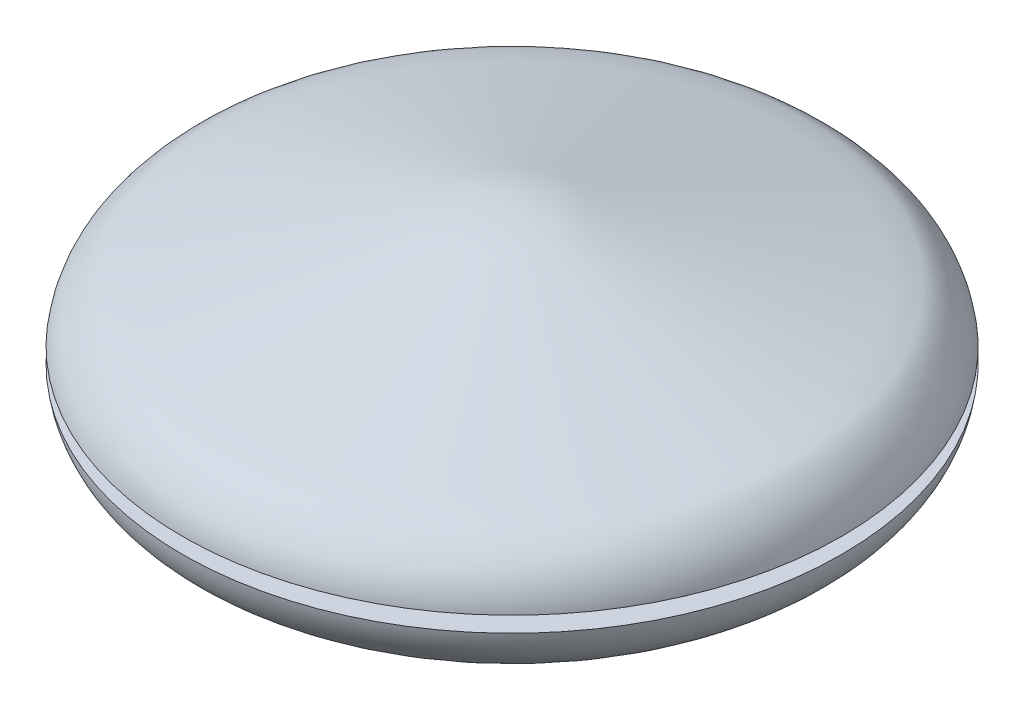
from build123d import *

# Parameters (mm, degrees)
SKETCH2_R       = 64.75
SKETCH2_R_2     = 57.15
EDGE_SLOT_DEPTH = 1.5


with BuildPart() as part:
    # Sketch1 → Case Body (revolve)
    with BuildSketch(Plane.XY):
        with BuildLine():
            Line((0, -19.5), (0, 25))
            add(Edge.make_bspline(
                [(0, 25), (2.908278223, 25), (5.802637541, 24.715805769), (8.655373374, 24.150137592), (8.971781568, 24.087397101), (9.60323359, 23.955035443), (10.548180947, 23.742598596), (11.171468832, 23.576122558), (11.483112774, 23.492884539), (11.794756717, 23.40964652), (12.418044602, 23.243170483), (13.352976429, 22.993456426), (13.976264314, 22.826980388), (14.287908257, 22.743742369), (24.038596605, 20.139398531), (33.789284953, 17.535054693), (43.5399733, 14.930710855), (44.727264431, 14.613593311), (47.101846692, 13.979358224), (50.663720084, 13.028005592), (53.038302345, 12.393770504), (54.225593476, 12.07665296), (55.126221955, 11.836101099), (56.927478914, 11.354997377), (59.328514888, 9.462363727), (60.588960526, 8.072845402), (61.13463646, 7.317044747), (64.763783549, 2.290413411), (64.39734753, -3.898565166), (60.200403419, -8.461830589), (59.569353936, -9.147959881), (58.153748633, -10.379035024), (55.546153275, -11.975118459), (53.700709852, -12.240308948), (52.777988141, -12.372904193), (51.487756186, -12.558310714), (48.907292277, -12.929123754), (45.036596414, -13.485343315), (42.456132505, -13.856156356), (41.165900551, -14.041562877), (30.077668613, -15.634943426), (18.989436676, -17.228323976), (7.901204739, -18.821704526), (7.726586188, -18.846797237), (7.377349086, -18.89698266), (6.853493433, -18.972260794), (6.504256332, -19.022446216), (6.329637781, -19.047538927), (6.15501923, -19.072631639), (5.805782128, -19.122817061), (5.280275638, -19.186672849), (4.9296947, -19.226453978), (4.754292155, -19.245301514), (3.174831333, -19.415019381), (1.588553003, -19.5), (0, -19.5)],
                knots=[0, 0, 0, 0, 0.061375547, 0.061375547, 0.061375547, 0.068204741, 0.075033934, 0.081863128, 0.081863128, 0.081863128, 0.088692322, 0.095521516, 0.102350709, 0.102350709, 0.102350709, 0.316021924, 0.316021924, 0.316021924, 0.342039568, 0.368057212, 0.394074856, 0.394074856, 0.394074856, 0.413810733, 0.433546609, 0.453282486, 0.453282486, 0.453282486, 0.56483054, 0.56483054, 0.56483054, 0.584566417, 0.604302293, 0.62403817, 0.62403817, 0.62403817, 0.651634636, 0.679231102, 0.706827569, 0.706827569, 0.706827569, 0.94399114, 0.94399114, 0.94399114, 0.947726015, 0.95146089, 0.955195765, 0.955195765, 0.955195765, 0.958930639, 0.962665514, 0.966400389, 0.966400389, 0.966400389, 1, 1, 1, 1], degree=3, weights=[1, 0.99680936, 0.99680936, 1, 1, 1, 1, 1, 1, 1, 1, 1, 1, 1, 1, 1, 1, 1, 1, 1, 1, 1, 1, 1, 1, 1, 1, 0.849837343, 0.849837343, 1, 1, 1, 1, 1, 1, 1, 1, 1, 1, 1, 1, 1, 1, 1, 1, 1, 1, 1, 1, 1, 1, 1, 1, 0.99904539, 0.99904539, 1]))
        make_face()
    revolve(axis=Axis((0, -19.5, 0), (0, 1, 0)))

    # Sketch2 → Edge Slot (cut, symmetric)
    with BuildSketch(Plane(origin=(0, 0, 0), x_dir=(1, 0, 0), z_dir=(0, 1, 0))):
        Circle(SKETCH2_R)
        Circle(SKETCH2_R_2, mode=Mode.SUBTRACT)
    extrude(amount=EDGE_SLOT_DEPTH, both=True, mode=Mode.SUBTRACT)


solid = part.part
